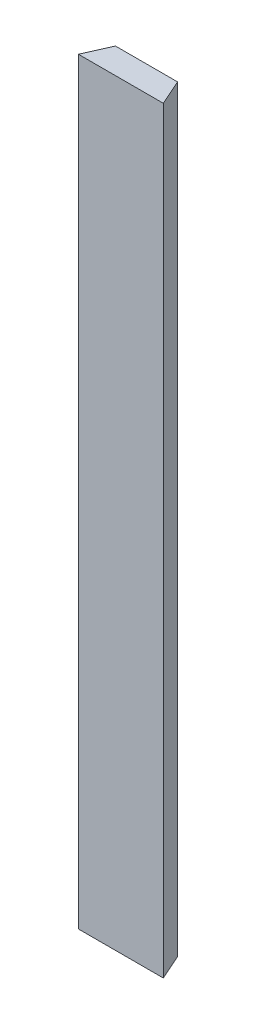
from build123d import *

# Parameters (mm, degrees)
BOSS_EXTRUDE1_DEPTH = 1219.2


with BuildPart() as part:
    # Sketch1 → Boss-Extrude1 (new body)
    with BuildSketch(Plane(origin=(0, 0, 0), x_dir=(1, 0, 0), z_dir=(0, 1, 0))):
        Polygon((0, 0), (136.525, 0), (118.26875, 41.275), (18.25625, 41.275), align=None)
    extrude(amount=BOSS_EXTRUDE1_DEPTH)


solid = part.part
